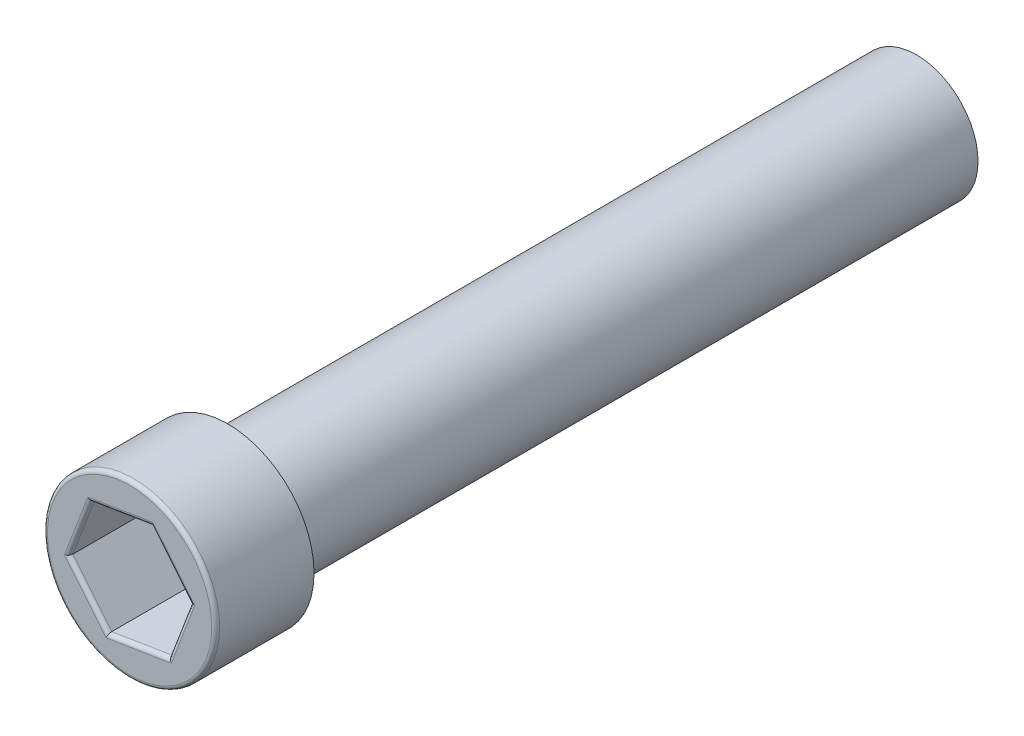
ISO-10303-21;
HEADER;
FILE_DESCRIPTION(('STEP AP214'),'2;1');
FILE_NAME('part.step','',(''),(''),'','','');
FILE_SCHEMA(('AUTOMOTIVE_DESIGN { 1 0 10303 214 1 1 1 1 }'));
ENDSEC;
DATA;
#1=APPLICATION_CONTEXT('core data for automotive mechanical design processes');
#2=APPLICATION_PROTOCOL_DEFINITION('international standard','automotive_design',2000,#1);
#3=PRODUCT_CONTEXT('',#1,'mechanical');
#4=PRODUCT('Part','Part','',(#3));
#5=PRODUCT_RELATED_PRODUCT_CATEGORY('part','',(#4));
#6=PRODUCT_DEFINITION_FORMATION('','',#4);
#7=PRODUCT_DEFINITION_CONTEXT('part definition',#1,'design');
#8=PRODUCT_DEFINITION('design','',#6,#7);
#9=PRODUCT_DEFINITION_SHAPE('','',#8);
#10=(LENGTH_UNIT() NAMED_UNIT(*) SI_UNIT(.MILLI.,.METRE.));
#11=(NAMED_UNIT(*) PLANE_ANGLE_UNIT() SI_UNIT($,.RADIAN.));
#12=(NAMED_UNIT(*) SI_UNIT($,.STERADIAN.) SOLID_ANGLE_UNIT());
#13=UNCERTAINTY_MEASURE_WITH_UNIT(LENGTH_MEASURE(1.E-05),#10,'distance_accuracy_value','');
#14=(GEOMETRIC_REPRESENTATION_CONTEXT(3) GLOBAL_UNCERTAINTY_ASSIGNED_CONTEXT((#13)) GLOBAL_UNIT_ASSIGNED_CONTEXT((#10,
#11,#12)) REPRESENTATION_CONTEXT('',''));
#15=CARTESIAN_POINT('',(0.,0.,0.));
#16=DIRECTION('',(0.,0.,1.));
#17=DIRECTION('',(1.,0.,0.));
#18=AXIS2_PLACEMENT_3D('',#15,#16,#17);
#19=CARTESIAN_POINT('',(0.,0.,50.8));
#20=DIRECTION('',(0.,0.,1.));
#21=DIRECTION('',(1.,0.,0.));
#22=AXIS2_PLACEMENT_3D('',#19,#20,#21);
#23=PLANE('',#22);
#24=DIRECTION('',(-0.354797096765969,-0.934943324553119,0.));
#25=VECTOR('',#24,1.);
#26=CARTESIAN_POINT('',(3.45091163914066,-1.30956968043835,50.8));
#27=LINE('',#26,#25);
#28=CARTESIAN_POINT('',(4.20699204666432,0.682815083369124,50.8));
#29=VERTEX_POINT('',#28);
#30=CARTESIAN_POINT('',(2.69483123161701,-3.30195444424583,50.8));
#31=VERTEX_POINT('',#30);
#32=EDGE_CURVE('E201',#29,#31,#27,.T.);
#33=ORIENTED_EDGE('',*,*,#32,.T.);
#34=DIRECTION('',(-0.987083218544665,-0.160208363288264,0.));
#35=VECTOR('',#34,1.);
#36=CARTESIAN_POINT('',(0.591335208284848,-3.64336198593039,50.8));
#37=LINE('',#36,#35);
#38=CARTESIAN_POINT('',(-1.51216081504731,-3.98476952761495,50.8));
#39=VERTEX_POINT('',#38);
#40=EDGE_CURVE('E204',#31,#39,#37,.T.);
#41=ORIENTED_EDGE('',*,*,#40,.T.);
#42=DIRECTION('',(-0.632286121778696,0.774734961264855,0.));
#43=VECTOR('',#42,1.);
#44=CARTESIAN_POINT('',(-2.85957643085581,-2.33379230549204,50.8));
#45=LINE('',#44,#43);
#46=CARTESIAN_POINT('',(-4.20699204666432,-0.682815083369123,50.8));
#47=VERTEX_POINT('',#46);
#48=EDGE_CURVE('E189',#39,#47,#45,.T.);
#49=ORIENTED_EDGE('',*,*,#48,.T.);
#50=DIRECTION('',(0.354797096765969,0.934943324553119,0.));
#51=VECTOR('',#50,1.);
#52=CARTESIAN_POINT('',(-3.45091163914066,1.30956968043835,50.8));
#53=LINE('',#52,#51);
#54=CARTESIAN_POINT('',(-2.69483123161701,3.30195444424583,50.8));
#55=VERTEX_POINT('',#54);
#56=EDGE_CURVE('E192',#47,#55,#53,.T.);
#57=ORIENTED_EDGE('',*,*,#56,.T.);
#58=DIRECTION('',(0.987083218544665,0.160208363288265,0.));
#59=VECTOR('',#58,1.);
#60=CARTESIAN_POINT('',(-0.59133520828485,3.64336198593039,50.8));
#61=LINE('',#60,#59);
#62=CARTESIAN_POINT('',(1.51216081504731,3.98476952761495,50.8));
#63=VERTEX_POINT('',#62);
#64=EDGE_CURVE('E195',#55,#63,#61,.T.);
#65=ORIENTED_EDGE('',*,*,#64,.T.);
#66=DIRECTION('',(0.632286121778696,-0.774734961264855,0.));
#67=VECTOR('',#66,1.);
#68=CARTESIAN_POINT('',(2.85957643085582,2.33379230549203,50.8));
#69=LINE('',#68,#67);
#70=EDGE_CURVE('E198',#63,#29,#69,.T.);
#71=ORIENTED_EDGE('',*,*,#70,.T.);
#72=EDGE_LOOP('',(#33,#41,#49,#57,#65,#71));
#73=FACE_BOUND('',#72,.T.);
#74=CARTESIAN_POINT('',(0.,0.,50.8));
#75=DIRECTION('',(0.,0.,1.));
#76=DIRECTION('',(1.,0.,0.));
#77=AXIS2_PLACEMENT_3D('',#74,#75,#76);
#78=CIRCLE('',#77,5.30225);
#79=CARTESIAN_POINT('',(5.30225,0.,50.8));
#80=VERTEX_POINT('',#79);
#81=EDGE_CURVE('E178',#80,#80,#78,.T.);
#82=ORIENTED_EDGE('',*,*,#81,.T.);
#83=EDGE_LOOP('',(#82));
#84=FACE_BOUND('',#83,.T.);
#85=ADVANCED_FACE('F42',(#73,#84),#23,.T.);
#86=CARTESIAN_POINT('',(0.,0.,44.45));
#87=DIRECTION('',(0.,0.,-1.));
#88=DIRECTION('',(-1.,0.,0.));
#89=AXIS2_PLACEMENT_3D('',#86,#87,#88);
#90=CYLINDRICAL_SURFACE('',#89,3.96875);
#91=CARTESIAN_POINT('',(0.,0.,44.45));
#92=DIRECTION('',(0.,0.,1.));
#93=DIRECTION('',(1.,0.,0.));
#94=AXIS2_PLACEMENT_3D('',#91,#92,#93);
#95=CIRCLE('',#94,3.96875);
#96=CARTESIAN_POINT('',(3.96875,0.,44.45));
#97=VERTEX_POINT('',#96);
#98=EDGE_CURVE('E174',#97,#97,#95,.T.);
#99=ORIENTED_EDGE('',*,*,#98,.F.);
#100=EDGE_LOOP('',(#99));
#101=FACE_BOUND('',#100,.T.);
#102=CARTESIAN_POINT('',(0.,0.,0.));
#103=DIRECTION('',(0.,0.,1.));
#104=DIRECTION('',(1.,0.,0.));
#105=AXIS2_PLACEMENT_3D('',#102,#103,#104);
#106=CIRCLE('',#105,3.96875);
#107=CARTESIAN_POINT('',(3.96875,0.,0.));
#108=VERTEX_POINT('',#107);
#109=EDGE_CURVE('E173',#108,#108,#106,.T.);
#110=ORIENTED_EDGE('',*,*,#109,.T.);
#111=EDGE_LOOP('',(#110));
#112=FACE_BOUND('',#111,.T.);
#113=ADVANCED_FACE('F283',(#101,#112),#90,.T.);
#114=CARTESIAN_POINT('',(0.,0.,0.));
#115=DIRECTION('',(0.,0.,1.));
#116=DIRECTION('',(1.,0.,0.));
#117=AXIS2_PLACEMENT_3D('',#114,#115,#116);
#118=PLANE('',#117);
#119=ORIENTED_EDGE('',*,*,#109,.F.);
#120=EDGE_LOOP('',(#119));
#121=FACE_BOUND('',#120,.T.);
#122=ADVANCED_FACE('F288',(#121),#118,.F.);
#123=CARTESIAN_POINT('',(0.,0.,50.8));
#124=DIRECTION('',(0.,0.,-1.));
#125=DIRECTION('',(-1.,0.,0.));
#126=AXIS2_PLACEMENT_3D('',#123,#124,#125);
#127=CYLINDRICAL_SURFACE('',#126,5.55625);
#128=CARTESIAN_POINT('',(0.,0.,50.546));
#129=DIRECTION('',(0.,0.,1.));
#130=DIRECTION('',(1.,0.,0.));
#131=AXIS2_PLACEMENT_3D('',#128,#129,#130);
#132=CIRCLE('',#131,5.55625);
#133=CARTESIAN_POINT('',(5.55625,0.,50.546));
#134=VERTEX_POINT('',#133);
#135=EDGE_CURVE('E185',#134,#134,#132,.F.);
#136=ORIENTED_EDGE('',*,*,#135,.T.);
#137=EDGE_LOOP('',(#136));
#138=FACE_BOUND('',#137,.T.);
#139=CARTESIAN_POINT('',(0.,0.,44.45));
#140=DIRECTION('',(0.,0.,1.));
#141=DIRECTION('',(1.,0.,0.));
#142=AXIS2_PLACEMENT_3D('',#139,#140,#141);
#143=CIRCLE('',#142,5.55625);
#144=CARTESIAN_POINT('',(5.55625,0.,44.45));
#145=VERTEX_POINT('',#144);
#146=EDGE_CURVE('E156',#145,#145,#143,.T.);
#147=ORIENTED_EDGE('',*,*,#146,.T.);
#148=EDGE_LOOP('',(#147));
#149=FACE_BOUND('',#148,.T.);
#150=ADVANCED_FACE('F297',(#138,#149),#127,.T.);
#151=CARTESIAN_POINT('',(0.,0.,44.45));
#152=DIRECTION('',(0.,0.,1.));
#153=DIRECTION('',(1.,0.,0.));
#154=AXIS2_PLACEMENT_3D('',#151,#152,#153);
#155=PLANE('',#154);
#156=ORIENTED_EDGE('',*,*,#98,.T.);
#157=EDGE_LOOP('',(#156));
#158=FACE_BOUND('',#157,.T.);
#159=ORIENTED_EDGE('',*,*,#146,.F.);
#160=EDGE_LOOP('',(#159));
#161=FACE_BOUND('',#160,.T.);
#162=ADVANCED_FACE('F294',(#158,#161),#155,.F.);
#163=CARTESIAN_POINT('',(-3.21343603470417,1.2194512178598,45.72));
#164=DIRECTION('',(0.934943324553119,-0.354797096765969,0.));
#165=DIRECTION('',(0.354797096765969,0.934943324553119,0.));
#166=AXIS2_PLACEMENT_3D('',#163,#164,#165);
#167=PLANE('',#166);
#168=DIRECTION('',(0.,0.,1.));
#169=VECTOR('',#168,1.);
#170=CARTESIAN_POINT('',(-2.5093855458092,3.07472937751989,45.72));
#171=LINE('',#170,#169);
#172=CARTESIAN_POINT('',(-2.5093855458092,3.07472937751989,45.72));
#173=VERTEX_POINT('',#172);
#174=CARTESIAN_POINT('',(-2.5093855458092,3.07472937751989,50.546));
#175=VERTEX_POINT('',#174);
#176=EDGE_CURVE('E153',#173,#175,#171,.T.);
#177=ORIENTED_EDGE('',*,*,#176,.T.);
#178=DIRECTION('',(0.354797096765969,0.934943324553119,0.));
#179=VECTOR('',#178,1.);
#180=CARTESIAN_POINT('',(-3.21343603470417,1.2194512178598,50.546));
#181=LINE('',#180,#179);
#182=CARTESIAN_POINT('',(-3.91748652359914,-0.6358269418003,50.546));
#183=VERTEX_POINT('',#182);
#184=EDGE_CURVE('E52',#175,#183,#181,.F.);
#185=ORIENTED_EDGE('',*,*,#184,.T.);
#186=DIRECTION('',(0.,0.,1.));
#187=VECTOR('',#186,1.);
#188=CARTESIAN_POINT('',(-3.91748652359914,-0.6358269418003,45.72));
#189=LINE('',#188,#187);
#190=CARTESIAN_POINT('',(-3.91748652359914,-0.6358269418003,45.72));
#191=VERTEX_POINT('',#190);
#192=EDGE_CURVE('E119',#191,#183,#189,.T.);
#193=ORIENTED_EDGE('',*,*,#192,.F.);
#194=DIRECTION('',(0.354797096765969,0.934943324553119,0.));
#195=VECTOR('',#194,1.);
#196=CARTESIAN_POINT('',(-3.21343603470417,1.2194512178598,45.72));
#197=LINE('',#196,#195);
#198=EDGE_CURVE('E128',#191,#173,#197,.T.);
#199=ORIENTED_EDGE('',*,*,#198,.T.);
#200=EDGE_LOOP('',(#177,#185,#193,#199));
#201=FACE_BOUND('',#200,.T.);
#202=ADVANCED_FACE('F131',(#201),#167,.T.);
#203=CARTESIAN_POINT('',(-0.55064228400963,3.39264284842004,45.72));
#204=DIRECTION('',(0.160208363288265,-0.987083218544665,0.));
#205=DIRECTION('',(0.987083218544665,0.160208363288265,0.));
#206=AXIS2_PLACEMENT_3D('',#203,#204,#205);
#207=PLANE('',#206);
#208=DIRECTION('',(0.,0.,1.));
#209=VECTOR('',#208,1.);
#210=CARTESIAN_POINT('',(1.40810097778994,3.71055631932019,45.72));
#211=LINE('',#210,#209);
#212=CARTESIAN_POINT('',(1.40810097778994,3.71055631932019,45.72));
#213=VERTEX_POINT('',#212);
#214=CARTESIAN_POINT('',(1.40810097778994,3.71055631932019,50.546));
#215=VERTEX_POINT('',#214);
#216=EDGE_CURVE('E157',#213,#215,#211,.T.);
#217=ORIENTED_EDGE('',*,*,#216,.T.);
#218=DIRECTION('',(0.987083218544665,0.160208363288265,0.));
#219=VECTOR('',#218,1.);
#220=CARTESIAN_POINT('',(-0.55064228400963,3.39264284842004,50.546));
#221=LINE('',#220,#219);
#222=EDGE_CURVE('E67',#215,#175,#221,.F.);
#223=ORIENTED_EDGE('',*,*,#222,.T.);
#224=ORIENTED_EDGE('',*,*,#176,.F.);
#225=DIRECTION('',(0.987083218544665,0.160208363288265,0.));
#226=VECTOR('',#225,1.);
#227=CARTESIAN_POINT('',(-0.55064228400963,3.39264284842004,45.72));
#228=LINE('',#227,#226);
#229=EDGE_CURVE('E133',#173,#213,#228,.T.);
#230=ORIENTED_EDGE('',*,*,#229,.T.);
#231=EDGE_LOOP('',(#217,#223,#224,#230));
#232=FACE_BOUND('',#231,.T.);
#233=ADVANCED_FACE('F409',(#232),#207,.T.);
#234=CARTESIAN_POINT('',(2.66279375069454,2.17319163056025,45.72));
#235=DIRECTION('',(-0.774734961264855,-0.632286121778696,0.));
#236=DIRECTION('',(0.632286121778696,-0.774734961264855,0.));
#237=AXIS2_PLACEMENT_3D('',#234,#235,#236);
#238=PLANE('',#237);
#239=DIRECTION('',(0.,0.,1.));
#240=VECTOR('',#239,1.);
#241=CARTESIAN_POINT('',(3.91748652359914,0.6358269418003,45.72));
#242=LINE('',#241,#240);
#243=CARTESIAN_POINT('',(3.91748652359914,0.6358269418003,45.72));
#244=VERTEX_POINT('',#243);
#245=CARTESIAN_POINT('',(3.91748652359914,0.6358269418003,50.546));
#246=VERTEX_POINT('',#245);
#247=EDGE_CURVE('E160',#244,#246,#242,.T.);
#248=ORIENTED_EDGE('',*,*,#247,.T.);
#249=DIRECTION('',(0.632286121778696,-0.774734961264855,0.));
#250=VECTOR('',#249,1.);
#251=CARTESIAN_POINT('',(2.66279375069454,2.17319163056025,50.546));
#252=LINE('',#251,#250);
#253=EDGE_CURVE('E215',#246,#215,#252,.F.);
#254=ORIENTED_EDGE('',*,*,#253,.T.);
#255=ORIENTED_EDGE('',*,*,#216,.F.);
#256=DIRECTION('',(0.632286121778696,-0.774734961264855,0.));
#257=VECTOR('',#256,1.);
#258=CARTESIAN_POINT('',(2.66279375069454,2.17319163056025,45.72));
#259=LINE('',#258,#257);
#260=EDGE_CURVE('E148',#213,#244,#259,.T.);
#261=ORIENTED_EDGE('',*,*,#260,.T.);
#262=EDGE_LOOP('',(#248,#254,#255,#261));
#263=FACE_BOUND('',#262,.T.);
#264=ADVANCED_FACE('F271',(#263),#238,.T.);
#265=CARTESIAN_POINT('',(3.21343603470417,-1.2194512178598,45.72));
#266=DIRECTION('',(-0.934943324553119,0.354797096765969,0.));
#267=DIRECTION('',(-0.354797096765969,-0.934943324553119,0.));
#268=AXIS2_PLACEMENT_3D('',#265,#266,#267);
#269=PLANE('',#268);
#270=DIRECTION('',(0.,0.,1.));
#271=VECTOR('',#270,1.);
#272=CARTESIAN_POINT('',(2.5093855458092,-3.07472937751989,45.72));
#273=LINE('',#272,#271);
#274=CARTESIAN_POINT('',(2.5093855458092,-3.07472937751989,45.72));
#275=VERTEX_POINT('',#274);
#276=CARTESIAN_POINT('',(2.5093855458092,-3.07472937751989,50.546));
#277=VERTEX_POINT('',#276);
#278=EDGE_CURVE('E164',#275,#277,#273,.T.);
#279=ORIENTED_EDGE('',*,*,#278,.T.);
#280=DIRECTION('',(-0.354797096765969,-0.934943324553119,0.));
#281=VECTOR('',#280,1.);
#282=CARTESIAN_POINT('',(3.21343603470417,-1.2194512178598,50.546));
#283=LINE('',#282,#281);
#284=EDGE_CURVE('E212',#277,#246,#283,.F.);
#285=ORIENTED_EDGE('',*,*,#284,.T.);
#286=ORIENTED_EDGE('',*,*,#247,.F.);
#287=DIRECTION('',(-0.354797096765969,-0.934943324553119,0.));
#288=VECTOR('',#287,1.);
#289=CARTESIAN_POINT('',(3.21343603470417,-1.2194512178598,45.72));
#290=LINE('',#289,#288);
#291=EDGE_CURVE('E145',#244,#275,#290,.T.);
#292=ORIENTED_EDGE('',*,*,#291,.T.);
#293=EDGE_LOOP('',(#279,#285,#286,#292));
#294=FACE_BOUND('',#293,.T.);
#295=ADVANCED_FACE('F267',(#294),#269,.T.);
#296=CARTESIAN_POINT('',(0.550642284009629,-3.39264284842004,45.72));
#297=DIRECTION('',(-0.160208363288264,0.987083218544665,0.));
#298=DIRECTION('',(-0.987083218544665,-0.160208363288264,0.));
#299=AXIS2_PLACEMENT_3D('',#296,#297,#298);
#300=PLANE('',#299);
#301=DIRECTION('',(0.,0.,1.));
#302=VECTOR('',#301,1.);
#303=CARTESIAN_POINT('',(-1.40810097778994,-3.71055631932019,45.72));
#304=LINE('',#303,#302);
#305=CARTESIAN_POINT('',(-1.40810097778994,-3.71055631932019,45.72));
#306=VERTEX_POINT('',#305);
#307=CARTESIAN_POINT('',(-1.40810097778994,-3.71055631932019,50.546));
#308=VERTEX_POINT('',#307);
#309=EDGE_CURVE('E122',#306,#308,#304,.T.);
#310=ORIENTED_EDGE('',*,*,#309,.T.);
#311=DIRECTION('',(-0.987083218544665,-0.160208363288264,0.));
#312=VECTOR('',#311,1.);
#313=CARTESIAN_POINT('',(0.550642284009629,-3.39264284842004,50.546));
#314=LINE('',#313,#312);
#315=EDGE_CURVE('E208',#308,#277,#314,.F.);
#316=ORIENTED_EDGE('',*,*,#315,.T.);
#317=ORIENTED_EDGE('',*,*,#278,.F.);
#318=DIRECTION('',(-0.987083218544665,-0.160208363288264,0.));
#319=VECTOR('',#318,1.);
#320=CARTESIAN_POINT('',(0.550642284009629,-3.39264284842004,45.72));
#321=LINE('',#320,#319);
#322=EDGE_CURVE('E127',#275,#306,#321,.T.);
#323=ORIENTED_EDGE('',*,*,#322,.T.);
#324=EDGE_LOOP('',(#310,#316,#317,#323));
#325=FACE_BOUND('',#324,.T.);
#326=ADVANCED_FACE('F256',(#325),#300,.T.);
#327=CARTESIAN_POINT('',(-2.66279375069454,-2.17319163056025,45.72));
#328=DIRECTION('',(0.774734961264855,0.632286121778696,0.));
#329=DIRECTION('',(-0.632286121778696,0.774734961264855,0.));
#330=AXIS2_PLACEMENT_3D('',#327,#328,#329);
#331=PLANE('',#330);
#332=ORIENTED_EDGE('',*,*,#192,.T.);
#333=DIRECTION('',(-0.632286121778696,0.774734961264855,0.));
#334=VECTOR('',#333,1.);
#335=CARTESIAN_POINT('',(-2.66279375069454,-2.17319163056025,50.546));
#336=LINE('',#335,#334);
#337=EDGE_CURVE('E11',#183,#308,#336,.F.);
#338=ORIENTED_EDGE('',*,*,#337,.T.);
#339=ORIENTED_EDGE('',*,*,#309,.F.);
#340=DIRECTION('',(-0.632286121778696,0.774734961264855,0.));
#341=VECTOR('',#340,1.);
#342=CARTESIAN_POINT('',(-2.66279375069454,-2.17319163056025,45.72));
#343=LINE('',#342,#341);
#344=EDGE_CURVE('E117',#306,#191,#343,.T.);
#345=ORIENTED_EDGE('',*,*,#344,.T.);
#346=EDGE_LOOP('',(#332,#338,#339,#345));
#347=FACE_BOUND('',#346,.T.);
#348=ADVANCED_FACE('F118',(#347),#331,.T.);
#349=CARTESIAN_POINT('',(0.,0.,45.72));
#350=DIRECTION('',(0.,0.,1.));
#351=DIRECTION('',(1.,0.,0.));
#352=AXIS2_PLACEMENT_3D('',#349,#350,#351);
#353=PLANE('',#352);
#354=ORIENTED_EDGE('',*,*,#198,.F.);
#355=ORIENTED_EDGE('',*,*,#344,.F.);
#356=ORIENTED_EDGE('',*,*,#322,.F.);
#357=ORIENTED_EDGE('',*,*,#291,.F.);
#358=ORIENTED_EDGE('',*,*,#260,.F.);
#359=ORIENTED_EDGE('',*,*,#229,.F.);
#360=EDGE_LOOP('',(#354,#355,#356,#357,#358,#359));
#361=FACE_BOUND('',#360,.T.);
#362=ADVANCED_FACE('F135',(#361),#353,.T.);
#363=CARTESIAN_POINT('',(0.,0.,50.546));
#364=DIRECTION('',(0.,0.,1.));
#365=DIRECTION('',(1.,0.,0.));
#366=AXIS2_PLACEMENT_3D('',#363,#364,#365);
#367=TOROIDAL_SURFACE('',#366,5.30225,0.254);
#368=ORIENTED_EDGE('',*,*,#135,.F.);
#369=EDGE_LOOP('',(#368));
#370=FACE_BOUND('',#369,.T.);
#371=ORIENTED_EDGE('',*,*,#81,.F.);
#372=EDGE_LOOP('',(#371));
#373=FACE_BOUND('',#372,.T.);
#374=ADVANCED_FACE('F281',(#370,#373),#367,.T.);
#375=CARTESIAN_POINT('',(-0.59133520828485,3.64336198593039,50.546));
#376=DIRECTION('',(0.987083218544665,0.160208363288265,0.));
#377=DIRECTION('',(-0.160208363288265,0.987083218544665,0.));
#378=AXIS2_PLACEMENT_3D('',#375,#376,#377);
#379=CYLINDRICAL_SURFACE('',#378,0.254);
#380=CARTESIAN_POINT('',(-2.69483123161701,3.30195444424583,50.546));
#381=DIRECTION('',(0.774734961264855,0.632286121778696,0.));
#382=DIRECTION('',(0.632286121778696,-0.774734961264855,0.));
#383=AXIS2_PLACEMENT_3D('',#380,#381,#382);
#384=ELLIPSE('',#383,0.29329393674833,0.254);
#385=EDGE_CURVE('E141',#175,#55,#384,.F.);
#386=ORIENTED_EDGE('',*,*,#385,.F.);
#387=ORIENTED_EDGE('',*,*,#222,.F.);
#388=CARTESIAN_POINT('',(1.51216081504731,3.98476952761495,50.546));
#389=DIRECTION('',(0.934943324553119,-0.354797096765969,0.));
#390=DIRECTION('',(-0.354797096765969,-0.934943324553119,0.));
#391=AXIS2_PLACEMENT_3D('',#388,#389,#390);
#392=ELLIPSE('',#391,0.29329393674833,0.254);
#393=EDGE_CURVE('E46',#63,#215,#392,.T.);
#394=ORIENTED_EDGE('',*,*,#393,.F.);
#395=ORIENTED_EDGE('',*,*,#64,.F.);
#396=EDGE_LOOP('',(#386,#387,#394,#395));
#397=FACE_BOUND('',#396,.T.);
#398=ADVANCED_FACE('F44',(#397),#379,.T.);
#399=CARTESIAN_POINT('',(2.85957643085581,2.33379230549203,50.546));
#400=DIRECTION('',(0.632286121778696,-0.774734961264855,0.));
#401=DIRECTION('',(0.774734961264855,0.632286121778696,0.));
#402=AXIS2_PLACEMENT_3D('',#399,#400,#401);
#403=CYLINDRICAL_SURFACE('',#402,0.254);
#404=ORIENTED_EDGE('',*,*,#393,.T.);
#405=ORIENTED_EDGE('',*,*,#253,.F.);
#406=CARTESIAN_POINT('',(4.20699204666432,0.682815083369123,50.546));
#407=DIRECTION('',(0.160208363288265,-0.987083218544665,0.));
#408=DIRECTION('',(-0.987083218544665,-0.160208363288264,0.));
#409=AXIS2_PLACEMENT_3D('',#406,#407,#408);
#410=ELLIPSE('',#409,0.29329393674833,0.254);
#411=EDGE_CURVE('E232',#29,#246,#410,.T.);
#412=ORIENTED_EDGE('',*,*,#411,.F.);
#413=ORIENTED_EDGE('',*,*,#70,.F.);
#414=EDGE_LOOP('',(#404,#405,#412,#413));
#415=FACE_BOUND('',#414,.T.);
#416=ADVANCED_FACE('F274',(#415),#403,.T.);
#417=CARTESIAN_POINT('',(-3.45091163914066,1.30956968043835,50.546));
#418=DIRECTION('',(0.354797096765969,0.934943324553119,0.));
#419=DIRECTION('',(-0.934943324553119,0.354797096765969,0.));
#420=AXIS2_PLACEMENT_3D('',#417,#418,#419);
#421=CYLINDRICAL_SURFACE('',#420,0.254);
#422=ORIENTED_EDGE('',*,*,#385,.T.);
#423=ORIENTED_EDGE('',*,*,#56,.F.);
#424=CARTESIAN_POINT('',(-4.20699204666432,-0.682815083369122,50.546));
#425=DIRECTION('',(-0.160208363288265,0.987083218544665,0.));
#426=DIRECTION('',(0.987083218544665,0.160208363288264,0.));
#427=AXIS2_PLACEMENT_3D('',#424,#425,#426);
#428=ELLIPSE('',#427,0.29329393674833,0.254);
#429=EDGE_CURVE('E228',#183,#47,#428,.F.);
#430=ORIENTED_EDGE('',*,*,#429,.F.);
#431=ORIENTED_EDGE('',*,*,#184,.F.);
#432=EDGE_LOOP('',(#422,#423,#430,#431));
#433=FACE_BOUND('',#432,.T.);
#434=ADVANCED_FACE('F240',(#433),#421,.T.);
#435=CARTESIAN_POINT('',(3.45091163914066,-1.30956968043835,50.546));
#436=DIRECTION('',(-0.354797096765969,-0.934943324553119,0.));
#437=DIRECTION('',(0.934943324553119,-0.354797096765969,0.));
#438=AXIS2_PLACEMENT_3D('',#435,#436,#437);
#439=CYLINDRICAL_SURFACE('',#438,0.254);
#440=ORIENTED_EDGE('',*,*,#411,.T.);
#441=ORIENTED_EDGE('',*,*,#284,.F.);
#442=CARTESIAN_POINT('',(2.694831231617,-3.30195444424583,50.546));
#443=DIRECTION('',(-0.774734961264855,-0.632286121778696,0.));
#444=DIRECTION('',(-0.632286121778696,0.774734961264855,0.));
#445=AXIS2_PLACEMENT_3D('',#442,#443,#444);
#446=ELLIPSE('',#445,0.29329393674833,0.254);
#447=EDGE_CURVE('E225',#31,#277,#446,.T.);
#448=ORIENTED_EDGE('',*,*,#447,.F.);
#449=ORIENTED_EDGE('',*,*,#32,.F.);
#450=EDGE_LOOP('',(#440,#441,#448,#449));
#451=FACE_BOUND('',#450,.T.);
#452=ADVANCED_FACE('F264',(#451),#439,.T.);
#453=CARTESIAN_POINT('',(-2.85957643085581,-2.33379230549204,50.546));
#454=DIRECTION('',(-0.632286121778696,0.774734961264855,0.));
#455=DIRECTION('',(-0.774734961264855,-0.632286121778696,0.));
#456=AXIS2_PLACEMENT_3D('',#453,#454,#455);
#457=CYLINDRICAL_SURFACE('',#456,0.254);
#458=ORIENTED_EDGE('',*,*,#429,.T.);
#459=ORIENTED_EDGE('',*,*,#48,.F.);
#460=CARTESIAN_POINT('',(-1.51216081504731,-3.98476952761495,50.546));
#461=DIRECTION('',(-0.934943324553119,0.354797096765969,0.));
#462=DIRECTION('',(-0.354797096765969,-0.934943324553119,0.));
#463=AXIS2_PLACEMENT_3D('',#460,#461,#462);
#464=ELLIPSE('',#463,0.29329393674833,0.254);
#465=EDGE_CURVE('E222',#308,#39,#464,.F.);
#466=ORIENTED_EDGE('',*,*,#465,.F.);
#467=ORIENTED_EDGE('',*,*,#337,.F.);
#468=EDGE_LOOP('',(#458,#459,#466,#467));
#469=FACE_BOUND('',#468,.T.);
#470=ADVANCED_FACE('F252',(#469),#457,.T.);
#471=CARTESIAN_POINT('',(0.591335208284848,-3.64336198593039,50.546));
#472=DIRECTION('',(-0.987083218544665,-0.160208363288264,0.));
#473=DIRECTION('',(0.160208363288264,-0.987083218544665,0.));
#474=AXIS2_PLACEMENT_3D('',#471,#472,#473);
#475=CYLINDRICAL_SURFACE('',#474,0.254);
#476=ORIENTED_EDGE('',*,*,#447,.T.);
#477=ORIENTED_EDGE('',*,*,#315,.F.);
#478=ORIENTED_EDGE('',*,*,#465,.T.);
#479=ORIENTED_EDGE('',*,*,#40,.F.);
#480=EDGE_LOOP('',(#476,#477,#478,#479));
#481=FACE_BOUND('',#480,.T.);
#482=ADVANCED_FACE('F259',(#481),#475,.T.);
#483=CLOSED_SHELL('',(#85,#113,#122,#150,#162,#202,#233,#264,#295,#326,#348,#362,#374,#398,#416,
#434,#452,#470,#482));
#484=MANIFOLD_SOLID_BREP('B2',#483);
#485=ADVANCED_BREP_SHAPE_REPRESENTATION('',(#18,#484),#14);
#486=SHAPE_DEFINITION_REPRESENTATION(#9,#485);
ENDSEC;
END-ISO-10303-21;
